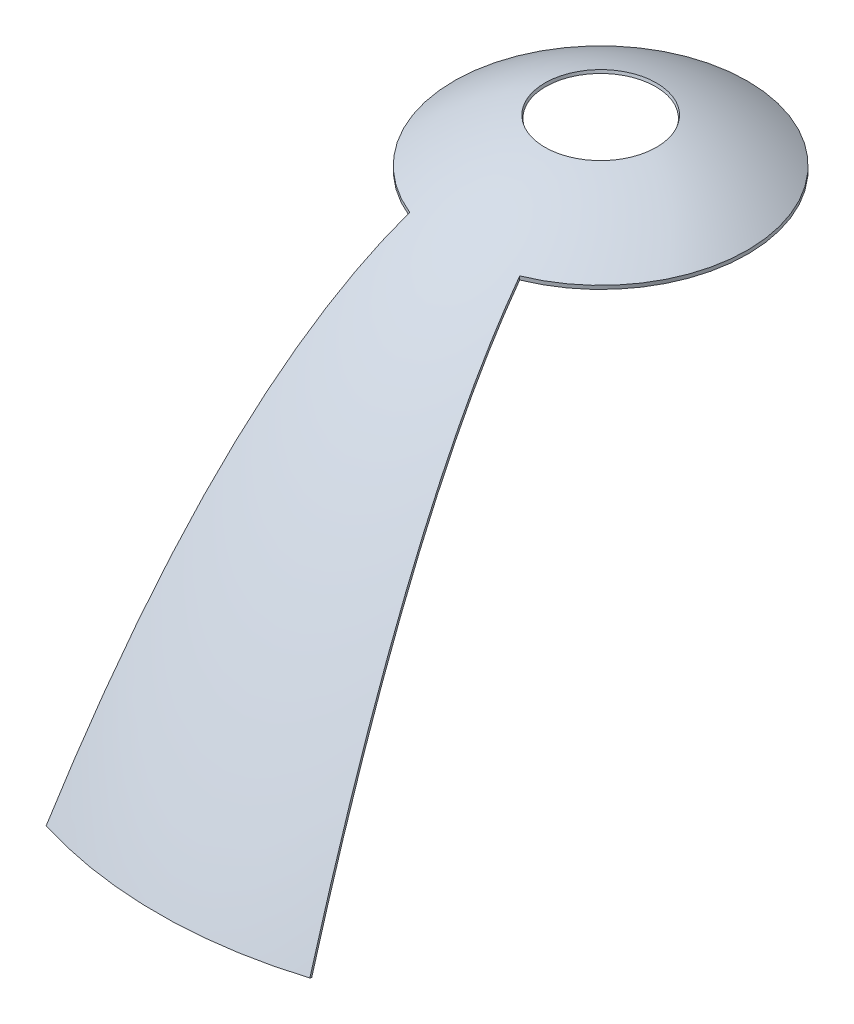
from build123d import *

# Parameters (mm, degrees)
LINEAR_AUSTRAGEN2_DEPTH      = 80
LINEAR_AUSTRAGEN2_DEPTH_BACK = 46
SKIZZE3_OUTSIDE_W            = 159.214
SKIZZE3_OUTSIDE_H            = 159.214


with BuildPart() as part:
    # Skizze1 → Rotation1 (revolve)
    with BuildSketch(Plane.XY, mode=Mode.PRIVATE) as rotation1_sk:
        with BuildLine():
            Line((-60.364609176, 0.164499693), (-60, 0))
            add(Edge.make_bspline(
                [(-60, 0), (-34.451802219, 56.626849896), (-7.5, 63.860230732)],
                knots=[0, 0, 0, 1, 1, 1], degree=2))
            Line((-7.5, 63.860230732), (-7.603683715, 64.246559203))
            add(Edge.make_bspline(
                [(-60.364609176, 0.164499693), (-59.837687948, 1.33240553), (-58.762424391, 3.681475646), (-56.629511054, 8.203670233), (-53.948792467, 13.631979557), (-50.72341987, 19.753849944), (-46.406081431, 27.405391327), (-40.979913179, 36.006555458), (-34.418511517, 44.789058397), (-27.805372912, 52.032232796), (-21.133960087, 57.736130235), (-15.531184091, 61.201627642), (-11.002412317, 63.203183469), (-8.756139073, 63.93726083), (-7.603683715, 64.246559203)],
                knots=[0.496025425, 0.496025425, 0.496025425, 0.496025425, 0.49613526, 0.496245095, 0.496464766, 0.496684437, 0.496904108, 0.49734345, 0.497782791, 0.498222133, 0.498661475, 0.499100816, 0.499320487, 0.499540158, 0.499540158, 0.499540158, 0.499540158], degree=3))
        make_face()
    revolve(rotation1_sk.sketch.rotate(Axis((0, 0, 0), (0, 1, 0)), 270), axis=Axis((0, 0, 0), (0, 1, 0)))

    # Skizze3 outside → Linear austragen2 (cut, two sides: drawn at the far end of the back side and taken through both)
    with BuildSketch(Plane(origin=(0, 0, 0), x_dir=(1, 0, 0), z_dir=(0, 1, 0)).offset(-LINEAR_AUSTRAGEN2_DEPTH_BACK)):
        Rectangle(SKIZZE3_OUTSIDE_W, SKIZZE3_OUTSIDE_H)
        with BuildLine():
            Line((-7.5, -18.540496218), (-17.973152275, -57.626832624))
            Line((-17.973152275, -57.626832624), (-17.973152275, -70.659769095))
            Line((-17.973152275, -70.659769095), (17.973152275, -70.659769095))
            Line((17.973152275, -70.659769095), (17.973152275, -57.626832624))
            Line((17.973152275, -57.626832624), (7.5, -18.540496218))
            ThreePointArc((7.5, -18.540496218), (0, 20), (-7.5, -18.540496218))
        make_face(mode=Mode.SUBTRACT)
    extrude(amount=LINEAR_AUSTRAGEN2_DEPTH + LINEAR_AUSTRAGEN2_DEPTH_BACK, mode=Mode.SUBTRACT)


solid = part.part
